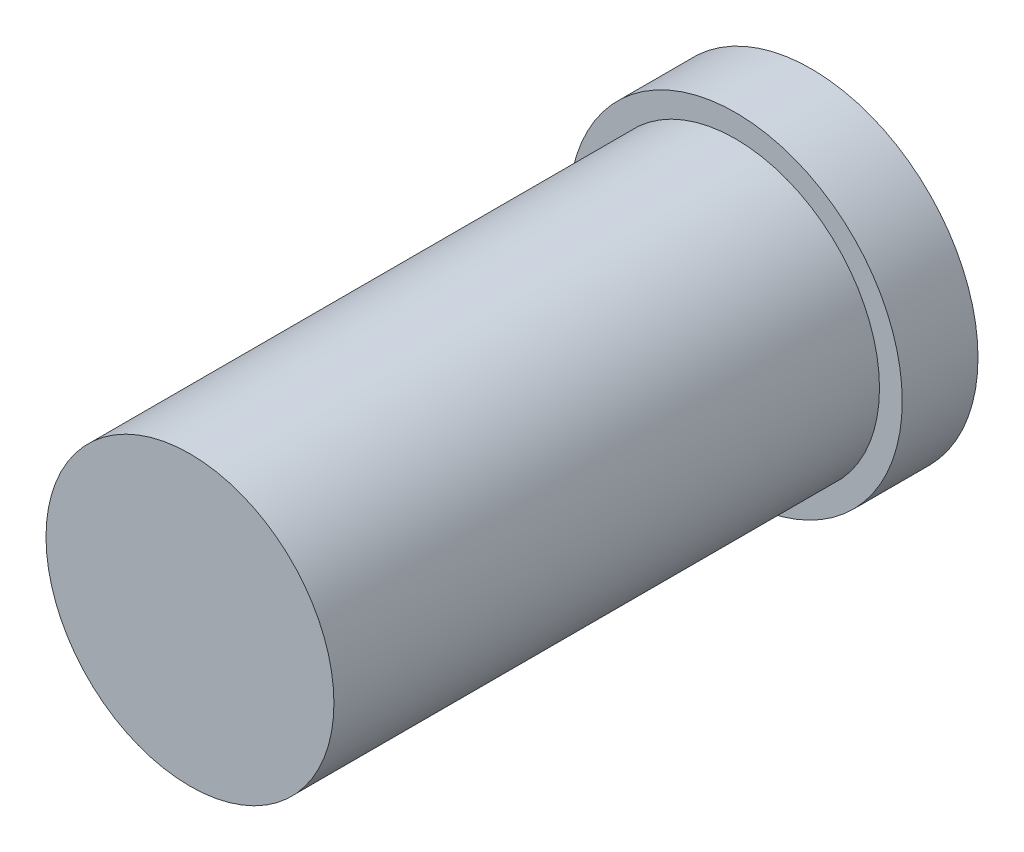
ISO-10303-21;
HEADER;
FILE_DESCRIPTION(('STEP AP214'),'2;1');
FILE_NAME('part.step','',(''),(''),'','','');
FILE_SCHEMA(('AUTOMOTIVE_DESIGN { 1 0 10303 214 1 1 1 1 }'));
ENDSEC;
DATA;
#1=APPLICATION_CONTEXT('core data for automotive mechanical design processes');
#2=APPLICATION_PROTOCOL_DEFINITION('international standard','automotive_design',2000,#1);
#3=PRODUCT_CONTEXT('',#1,'mechanical');
#4=PRODUCT('Part','Part','',(#3));
#5=PRODUCT_RELATED_PRODUCT_CATEGORY('part','',(#4));
#6=PRODUCT_DEFINITION_FORMATION('','',#4);
#7=PRODUCT_DEFINITION_CONTEXT('part definition',#1,'design');
#8=PRODUCT_DEFINITION('design','',#6,#7);
#9=PRODUCT_DEFINITION_SHAPE('','',#8);
#10=(LENGTH_UNIT() NAMED_UNIT(*) SI_UNIT(.MILLI.,.METRE.));
#11=(NAMED_UNIT(*) PLANE_ANGLE_UNIT() SI_UNIT($,.RADIAN.));
#12=(NAMED_UNIT(*) SI_UNIT($,.STERADIAN.) SOLID_ANGLE_UNIT());
#13=UNCERTAINTY_MEASURE_WITH_UNIT(LENGTH_MEASURE(1.E-05),#10,'distance_accuracy_value','');
#14=(GEOMETRIC_REPRESENTATION_CONTEXT(3) GLOBAL_UNCERTAINTY_ASSIGNED_CONTEXT((#13)) GLOBAL_UNIT_ASSIGNED_CONTEXT((#10,
#11,#12)) REPRESENTATION_CONTEXT('',''));
#15=CARTESIAN_POINT('',(0.,0.,0.));
#16=DIRECTION('',(0.,0.,1.));
#17=DIRECTION('',(1.,0.,0.));
#18=AXIS2_PLACEMENT_3D('',#15,#16,#17);
#19=CARTESIAN_POINT('',(0.,0.,5.));
#20=DIRECTION('',(0.,0.,-1.));
#21=DIRECTION('',(-1.,0.,0.));
#22=AXIS2_PLACEMENT_3D('',#19,#20,#21);
#23=CYLINDRICAL_SURFACE('',#22,11.);
#24=CARTESIAN_POINT('',(0.,0.,5.));
#25=DIRECTION('',(0.,0.,1.));
#26=DIRECTION('',(1.,0.,0.));
#27=AXIS2_PLACEMENT_3D('',#24,#25,#26);
#28=CIRCLE('',#27,11.);
#29=CARTESIAN_POINT('',(11.,0.,5.));
#30=VERTEX_POINT('',#29);
#31=EDGE_CURVE('E47',#30,#30,#28,.T.);
#32=ORIENTED_EDGE('',*,*,#31,.F.);
#33=EDGE_LOOP('',(#32));
#34=FACE_BOUND('',#33,.T.);
#35=CARTESIAN_POINT('',(0.,0.,0.));
#36=DIRECTION('',(0.,0.,1.));
#37=DIRECTION('',(1.,0.,0.));
#38=AXIS2_PLACEMENT_3D('',#35,#36,#37);
#39=CIRCLE('',#38,11.);
#40=CARTESIAN_POINT('',(11.,0.,0.));
#41=VERTEX_POINT('',#40);
#42=EDGE_CURVE('E42',#41,#41,#39,.T.);
#43=ORIENTED_EDGE('',*,*,#42,.T.);
#44=EDGE_LOOP('',(#43));
#45=FACE_BOUND('',#44,.T.);
#46=ADVANCED_FACE('F39',(#34,#45),#23,.T.);
#47=CARTESIAN_POINT('',(0.,0.,5.));
#48=DIRECTION('',(0.,0.,1.));
#49=DIRECTION('',(1.,0.,0.));
#50=AXIS2_PLACEMENT_3D('',#47,#48,#49);
#51=PLANE('',#50);
#52=CARTESIAN_POINT('',(0.,0.,5.));
#53=DIRECTION('',(0.,0.,1.));
#54=DIRECTION('',(1.,0.,0.));
#55=AXIS2_PLACEMENT_3D('',#52,#53,#54);
#56=CIRCLE('',#55,9.5);
#57=CARTESIAN_POINT('',(9.5,0.,5.));
#58=VERTEX_POINT('',#57);
#59=EDGE_CURVE('E10',#58,#58,#56,.T.);
#60=ORIENTED_EDGE('',*,*,#59,.F.);
#61=EDGE_LOOP('',(#60));
#62=FACE_BOUND('',#61,.T.);
#63=ORIENTED_EDGE('',*,*,#31,.T.);
#64=EDGE_LOOP('',(#63));
#65=FACE_BOUND('',#64,.T.);
#66=ADVANCED_FACE('F70',(#62,#65),#51,.T.);
#67=CARTESIAN_POINT('',(0.,0.,0.));
#68=DIRECTION('',(0.,0.,1.));
#69=DIRECTION('',(1.,0.,0.));
#70=AXIS2_PLACEMENT_3D('',#67,#68,#69);
#71=PLANE('',#70);
#72=ORIENTED_EDGE('',*,*,#42,.F.);
#73=EDGE_LOOP('',(#72));
#74=FACE_BOUND('',#73,.T.);
#75=ADVANCED_FACE('F67',(#74),#71,.F.);
#76=CARTESIAN_POINT('',(0.,0.,41.));
#77=DIRECTION('',(0.,0.,-1.));
#78=DIRECTION('',(-1.,0.,0.));
#79=AXIS2_PLACEMENT_3D('',#76,#77,#78);
#80=CYLINDRICAL_SURFACE('',#79,9.5);
#81=CARTESIAN_POINT('',(0.,0.,41.));
#82=DIRECTION('',(0.,0.,1.));
#83=DIRECTION('',(1.,0.,0.));
#84=AXIS2_PLACEMENT_3D('',#81,#82,#83);
#85=CIRCLE('',#84,9.5);
#86=CARTESIAN_POINT('',(9.5,0.,41.));
#87=VERTEX_POINT('',#86);
#88=EDGE_CURVE('E55',#87,#87,#85,.T.);
#89=ORIENTED_EDGE('',*,*,#88,.F.);
#90=EDGE_LOOP('',(#89));
#91=FACE_BOUND('',#90,.T.);
#92=ORIENTED_EDGE('',*,*,#59,.T.);
#93=EDGE_LOOP('',(#92));
#94=FACE_BOUND('',#93,.T.);
#95=ADVANCED_FACE('F69',(#91,#94),#80,.T.);
#96=CARTESIAN_POINT('',(0.,0.,41.));
#97=DIRECTION('',(0.,0.,1.));
#98=DIRECTION('',(1.,0.,0.));
#99=AXIS2_PLACEMENT_3D('',#96,#97,#98);
#100=PLANE('',#99);
#101=ORIENTED_EDGE('',*,*,#88,.T.);
#102=EDGE_LOOP('',(#101));
#103=FACE_BOUND('',#102,.T.);
#104=ADVANCED_FACE('F76',(#103),#100,.T.);
#105=CLOSED_SHELL('',(#46,#66,#75,#95,#104));
#106=MANIFOLD_SOLID_BREP('B2',#105);
#107=ADVANCED_BREP_SHAPE_REPRESENTATION('',(#18,#106),#14);
#108=SHAPE_DEFINITION_REPRESENTATION(#9,#107);
ENDSEC;
END-ISO-10303-21;
